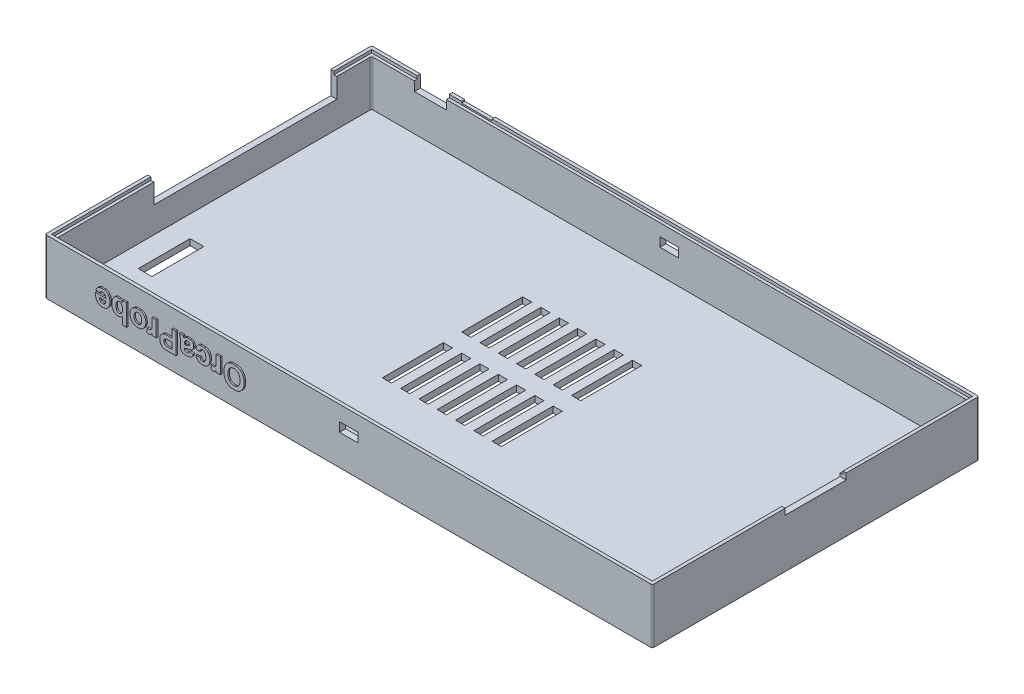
from build123d import *

# Parameters (mm, degrees)
SKETCH1_W               = 195
SKETCH1_H               = 103
BOSS_EXTRUDE1_DEPTH     = 2
SKETCH2_W               = 199
SKETCH2_H               = 107
SKETCH2_W_2             = 195
SKETCH2_H_2             = 103
BOSS_EXTRUDE2_DEPTH     = 18
SKETCH5_W               = 196.9
SKETCH5_H               = 104.9
SKETCH5_W_2             = 195
SKETCH5_H_2             = 103
CUT_EXTRUDE2_DEPTH      = 1
CUT_EXTRUDE3_DEPTH      = 146.77122487
CUT_EXTRUDE3_DEPTH_BACK = 146.77122487
SKETCH7_W               = 6.1
SKETCH7_H               = 3
SKETCH9_W               = 60
SKETCH9_H               = 7.5
CUT_EXTRUDE6_DEPTH      = 2
SKETCH10_W              = 10.5
SKETCH10_H              = 4
SKETCH10_W_2            = 10
SKETCH10_H_2            = 0.5
CUT_EXTRUDE7_DEPTH      = 2
SKETCH11_W              = 4.5
SKETCH11_H              = 17
CUT_EXTRUDE8_DEPTH      = 2
SKETCH12_W              = 3
SKETCH12_H              = 20
CUT_EXTRUDE9_DEPTH      = 2
FILLET1_R               = 0.5
SKETCH13_W              = 20
SKETCH13_H              = 2
CUT_EXTRUDE10_DEPTH     = 2
BOSS_EXTRUDE3_DEPTH     = 0.5


with BuildPart() as part:
    # Sketch1 → Boss-Extrude1 (new body)
    with BuildSketch(Plane(origin=(0, 0, 0), x_dir=(1, 0, 0), z_dir=(0, 1, 0))):
        Rectangle(SKETCH1_W, SKETCH1_H)
    extrude(amount=BOSS_EXTRUDE1_DEPTH)

    # Sketch2 → Boss-Extrude2 (add)
    with BuildSketch(Plane.XZ):
        Rectangle(SKETCH2_W, SKETCH2_H)
        Rectangle(SKETCH2_W_2, SKETCH2_H_2, mode=Mode.SUBTRACT)
    extrude(amount=-BOSS_EXTRUDE2_DEPTH)

    # Sketch5 → Cut-Extrude2 (cut)
    with BuildSketch(Plane(origin=(0, 18, 0), x_dir=(1, 0, 0), z_dir=(0, 1, 0))):
        Rectangle(SKETCH5_W, SKETCH5_H)
        Rectangle(SKETCH5_W_2, SKETCH5_H_2, mode=Mode.SUBTRACT)
    extrude(amount=-CUT_EXTRUDE2_DEPTH, mode=Mode.SUBTRACT)

    # Sketch7 → Cut-Extrude3 (cut, two sides: drawn at the far end of the back side and taken through both)
    with BuildSketch(Plane.XY.offset(-51.5).offset(-CUT_EXTRUDE3_DEPTH_BACK)):
        with Locations((0, 11.55)):
            Rectangle(SKETCH7_W, SKETCH7_H)
    extrude(amount=CUT_EXTRUDE3_DEPTH + CUT_EXTRUDE3_DEPTH_BACK, mode=Mode.SUBTRACT)

    # Sketch9 → Cut-Extrude6 (cut)
    with BuildSketch(Plane.ZY.offset(99.5)):
        with Locations((-10.12, 14.25)):
            Rectangle(SKETCH9_W, SKETCH9_H)
    extrude(amount=-CUT_EXTRUDE6_DEPTH, mode=Mode.SUBTRACT)

    # Sketch10 → Cut-Extrude7 (cut)
    with BuildSketch(Plane(origin=(0, 0, -53.5), x_dir=(-1, 0, 0), z_dir=(0, 0, -1))):
        with Locations((78.25, 16)):
            Rectangle(SKETCH10_W, SKETCH10_H)
        with Locations((64, 17.75)):
            Rectangle(SKETCH10_W_2, SKETCH10_H_2)
    extrude(amount=-CUT_EXTRUDE7_DEPTH, mode=Mode.SUBTRACT)

    # Sketch11 → Cut-Extrude8 (cut)
    with BuildSketch(Plane.XZ):
        with Locations((-88.25, 23.5)):
            Rectangle(SKETCH11_W, SKETCH11_H)
    extrude(amount=-CUT_EXTRUDE8_DEPTH, mode=Mode.SUBTRACT)

    # Sketch12 → Cut-Extrude9 (cut)
    with BuildSketch(Plane.XZ):
        with Locations((18, 13)):
            Rectangle(SKETCH12_W, SKETCH12_H)
        with Locations((12, 13)):
            Rectangle(SKETCH12_W, SKETCH12_H)
        with Locations((6, 13)):
            Rectangle(SKETCH12_W, SKETCH12_H)
        with Locations((0, 13)):
            Rectangle(SKETCH12_W, SKETCH12_H)
        with Locations((-6, 13)):
            Rectangle(SKETCH12_W, SKETCH12_H)
        with Locations((-12, 13)):
            Rectangle(SKETCH12_W, SKETCH12_H)
        with Locations((-18, 13)):
            Rectangle(SKETCH12_W, SKETCH12_H)
        with Locations((-18, -13)):
            Rectangle(SKETCH12_W, SKETCH12_H)
        with Locations((-12, -13)):
            Rectangle(SKETCH12_W, SKETCH12_H)
        with Locations((-6, -13)):
            Rectangle(SKETCH12_W, SKETCH12_H)
        with Locations((0, -13)):
            Rectangle(SKETCH12_W, SKETCH12_H)
        with Locations((6, -13)):
            Rectangle(SKETCH12_W, SKETCH12_H)
        with Locations((12, -13)):
            Rectangle(SKETCH12_W, SKETCH12_H)
        with Locations((18, -13)):
            Rectangle(SKETCH12_W, SKETCH12_H)
    extrude(amount=-CUT_EXTRUDE9_DEPTH, mode=Mode.SUBTRACT)

    # Fillet1
    fillet1_edges = [part.edges().sort_by_distance(p)[0] for p in [
        (99.5, 9, -53.5),
        (-99.5, 9, -53.5),
        (-99.5, 9, 53.5),
        (99.5, 9, 53.5),
        (97.5, 9.5, 51.5),
        (97.5, 9.5, -51.5),
        (-97.5, 9.5, 51.5),
        (-97.5, 9.5, -51.5),
    ]]
    fillet(fillet1_edges, radius=FILLET1_R)

    # Sketch13 → Cut-Extrude10 (cut)
    with BuildSketch(Plane(origin=(99.5, 0, 0), x_dir=(0, 0, -1), z_dir=(1, 0, 0))):
        with Locations((0, 17)):
            Rectangle(SKETCH13_W, SKETCH13_H)
    extrude(amount=-CUT_EXTRUDE10_DEPTH, mode=Mode.SUBTRACT)

    # Sketch8 → Boss-Extrude3 (add)
    # profile 1 of 9: a face of its own
    with BuildSketch(Plane.XY.offset(53.5)):
        with BuildLine():
            add(Edge.make_bspline(
                [(-79.430913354, 12.41834972), (-79.392604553, 12.408414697), (-79.266749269, 12.372799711), (-79.060539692, 12.29960703), (-78.825897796, 12.174820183), (-78.53667685, 11.978505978), (-78.358577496, 11.783308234), (-78.253719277, 11.644311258)],
                knots=[0.353866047, 0.353866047, 0.353866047, 0.353866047, 0.407200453, 0.530030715, 0.648157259, 0.764596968, 1, 1, 1, 1], degree=3))
            Line((-79.430913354, 12.41834972), (-80.951445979, 12.41834972))
            add(Edge.make_bspline(
                [(-82.418382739, 10.982452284), (-82.377144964, 11.102309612), (-82.305803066, 11.276218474), (-82.185018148, 11.491211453), (-82.089189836, 11.640443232), (-81.981871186, 11.777266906), (-81.864631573, 11.90199217), (-81.740376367, 12.018070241), (-81.604770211, 12.12017176), (-81.461028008, 12.211909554), (-81.308563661, 12.292420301), (-81.145654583, 12.357157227), (-81.025836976, 12.397918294), (-80.959939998, 12.416074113), (-80.951445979, 12.41834972)],
                knots=[0, 0, 0, 0, 0.131626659, 0.194390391, 0.255749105, 0.31553027, 0.374568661, 0.433277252, 0.491785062, 0.550461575, 0.610134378, 0.670403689, 0.73222858, 0.741356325, 0.741356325, 0.741356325, 0.741356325], degree=3))
            Line((-82.418382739, 10.982452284), (-81.072228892, 10.802965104))
            add(Edge.make_bspline(
                [(-80.208446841, 11.520913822), (-80.306629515, 11.51854586), (-80.454421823, 11.504680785), (-80.630237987, 11.427555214), (-80.748257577, 11.352564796), (-80.852225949, 11.252165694), (-80.976862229, 11.074695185), (-81.03929334, 10.915977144), (-81.072228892, 10.802965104)],
                knots=[0, 0, 0, 0, 0.243297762, 0.357088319, 0.469306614, 0.585549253, 0.70993853, 1, 1, 1, 1], degree=3))
            add(Edge.make_bspline(
                [(-79.097869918, 10.264503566), (-79.101712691, 10.358110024), (-79.109784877, 10.496623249), (-79.149459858, 10.671707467), (-79.183533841, 10.793037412), (-79.23007259, 10.904538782), (-79.285279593, 11.008445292), (-79.349753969, 11.104197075), (-79.424033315, 11.190812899), (-79.505440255, 11.26765374), (-79.591279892, 11.335287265), (-79.681300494, 11.393834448), (-79.777720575, 11.439926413), (-79.878558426, 11.47678371), (-80.021987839, 11.51043407), (-80.133214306, 11.520703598), (-80.208446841, 11.520913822)],
                knots=[0, 0, 0, 0, 0.149899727, 0.220143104, 0.286246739, 0.350812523, 0.412562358, 0.473814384, 0.534669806, 0.594305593, 0.652217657, 0.708925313, 0.765317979, 0.82243155, 0.8799772, 1, 1, 1, 1], degree=3))
            Line((-79.097869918, 10.264503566), (-82.508126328, 10.264503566))
            add(Edge.make_bspline(
                [(-80.086451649, 7.213221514), (-80.266742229, 7.21279231), (-80.532239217, 7.233364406), (-80.870493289, 7.313109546), (-81.103376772, 7.39671767), (-81.322218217, 7.501742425), (-81.525697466, 7.631623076), (-81.712653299, 7.786312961), (-81.886879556, 7.961288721), (-82.040309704, 8.163623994), (-82.172128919, 8.390955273), (-82.283111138, 8.642610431), (-82.372812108, 8.918811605), (-82.439093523, 9.220433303), (-82.502057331, 9.670431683), (-82.513628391, 10.022647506), (-82.508126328, 10.264503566)],
                knots=[0, 0, 0, 0, 0.12167826, 0.178742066, 0.234004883, 0.288309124, 0.3421997, 0.39643063, 0.451736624, 0.508442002, 0.567237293, 0.62865367, 0.693678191, 0.762844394, 0.836746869, 1, 1, 1, 1], degree=3))
            add(Edge.make_bspline(
                [(-77.751716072, 9.898517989), (-77.751429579, 9.699325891), (-77.768915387, 9.4072879), (-77.83930111, 9.033294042), (-77.912568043, 8.77721736), (-78.004321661, 8.537437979), (-78.119304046, 8.315508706), (-78.253531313, 8.109665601), (-78.409859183, 7.923891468), (-78.580250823, 7.756912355), (-78.763750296, 7.612290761), (-78.956107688, 7.486963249), (-79.161610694, 7.387740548), (-79.376754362, 7.307853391), (-79.684683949, 7.235214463), (-79.924167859, 7.212550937), (-80.086451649, 7.213221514)],
                knots=[0, 0, 0, 0, 0.149253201, 0.218402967, 0.284676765, 0.348527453, 0.41038283, 0.471562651, 0.532217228, 0.591888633, 0.649960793, 0.70697197, 0.76350051, 0.820546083, 0.87854748, 1, 1, 1, 1], degree=3))
            add(Edge.make_bspline(
                [(-78.253719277, 11.644311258), (-78.169261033, 11.528485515), (-78.058035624, 11.342120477), (-77.944666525, 11.073846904), (-77.872853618, 10.86126967), (-77.818479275, 10.636430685), (-77.764763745, 10.315799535), (-77.753605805, 10.067012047), (-77.751716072, 9.898517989)],
                knots=[0, 0, 0, 0, 0.232769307, 0.350791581, 0.472503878, 0.59678617, 0.726082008, 1, 1, 1, 1], degree=3))
        make_face()
        with BuildLine():
            Line((-81.161972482, 9.456811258), (-79.121708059, 9.456811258))
            add(Edge.make_bspline(
                [(-79.407765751, 8.538341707), (-79.359867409, 8.59527401), (-79.295556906, 8.688722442), (-79.228926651, 8.825832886), (-79.187987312, 8.937611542), (-79.157388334, 9.056970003), (-79.129258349, 9.230401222), (-79.121565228, 9.364974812), (-79.121708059, 9.456811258)],
                knots=[0, 0, 0, 0, 0.226972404, 0.344350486, 0.464385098, 0.589620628, 0.71976358, 1, 1, 1, 1], degree=3))
            add(Edge.make_bspline(
                [(-80.146748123, 8.200401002), (-80.074963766, 8.201448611), (-79.96814089, 8.209504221), (-79.832830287, 8.246199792), (-79.737577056, 8.282744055), (-79.647293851, 8.33093424), (-79.531847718, 8.410625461), (-79.455172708, 8.484893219), (-79.407765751, 8.538341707)],
                knots=[0, 0, 0, 0, 0.257037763, 0.379787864, 0.499815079, 0.620848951, 0.744538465, 1, 1, 1, 1], degree=3))
            add(Edge.make_bspline(
                [(-81.161972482, 9.456811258), (-81.158152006, 9.360299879), (-81.149320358, 9.218871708), (-81.115842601, 9.038361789), (-81.079329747, 8.916621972), (-81.038734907, 8.803271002), (-80.987592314, 8.699238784), (-80.926886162, 8.605084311), (-80.858852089, 8.519863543), (-80.783360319, 8.444999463), (-80.704327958, 8.37929489), (-80.620594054, 8.323870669), (-80.533488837, 8.279047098), (-80.442493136, 8.24327095), (-80.314372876, 8.209156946), (-80.213811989, 8.201998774), (-80.146748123, 8.200401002)],
                knots=[0, 0, 0, 0, 0.160305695, 0.234505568, 0.303939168, 0.370905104, 0.434007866, 0.495728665, 0.55638862, 0.614498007, 0.671773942, 0.726605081, 0.780696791, 0.833965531, 0.888499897, 1, 1, 1, 1], degree=3))
        make_face(mode=Mode.SUBTRACT)
    # profile 2 of 9: a face of its own
    with BuildSketch(Plane.XY.offset(53.5)):
        with BuildLine():
            Line((-72.277357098, 5.41834972), (-72.277357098, 12.41834972))
            Line((-72.277357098, 12.41834972), (-73.623510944, 12.41834972))
            Line((-73.623510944, 12.41834972), (-73.623510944, 11.679367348))
            add(Edge.make_bspline(
                [(-74.582243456, 12.41834972), (-74.558862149, 12.410350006), (-74.466900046, 12.376947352), (-74.308275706, 12.30789419), (-74.114291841, 12.193870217), (-73.870695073, 11.995504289), (-73.714084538, 11.81390674), (-73.623510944, 11.679367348)],
                knots=[0.307928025, 0.307928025, 0.307928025, 0.307928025, 0.349517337, 0.472531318, 0.598900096, 0.727130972, 1, 1, 1, 1], degree=3))
            Line((-74.582243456, 12.41834972), (-75.687295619, 12.41834972))
            add(Edge.make_bspline(
                [(-77.123510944, 9.808774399), (-77.121340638, 10.012764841), (-77.109224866, 10.311667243), (-77.044583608, 10.693611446), (-76.983283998, 10.954213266), (-76.899344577, 11.194861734), (-76.800668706, 11.418542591), (-76.680452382, 11.622292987), (-76.545053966, 11.807796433), (-76.394505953, 11.971262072), (-76.23626016, 12.115012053), (-76.069866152, 12.237206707), (-75.894780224, 12.335463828), (-75.765356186, 12.391237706), (-75.695370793, 12.415611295), (-75.687295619, 12.41834972)],
                knots=[0, 0, 0, 0, 0.162916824, 0.23775729, 0.308743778, 0.376187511, 0.440770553, 0.503436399, 0.56451039, 0.62362394, 0.680380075, 0.73481972, 0.787909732, 0.840195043, 0.846993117, 0.846993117, 0.846993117, 0.846993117], degree=3))
            add(Edge.make_bspline(
                [(-75.049592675, 7.213221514), (-75.193796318, 7.210912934), (-75.406500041, 7.233937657), (-75.679789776, 7.302657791), (-75.871058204, 7.378304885), (-76.053536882, 7.472303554), (-76.225548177, 7.588835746), (-76.38871655, 7.724943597), (-76.540065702, 7.88243775), (-76.677875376, 8.058947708), (-76.797374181, 8.255323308), (-76.898493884, 8.469757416), (-76.981100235, 8.702356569), (-77.045369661, 8.953464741), (-77.108505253, 9.322780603), (-77.121673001, 9.611701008), (-77.123510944, 9.808774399)],
                knots=[0, 0, 0, 0, 0.115439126, 0.170815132, 0.225536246, 0.280032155, 0.335141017, 0.391830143, 0.450160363, 0.510003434, 0.571085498, 0.634139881, 0.699833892, 0.768758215, 0.841794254, 1, 1, 1, 1], degree=3))
            add(Edge.make_bspline(
                [(-73.623510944, 7.912941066), (-73.719150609, 7.802384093), (-73.872597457, 7.649805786), (-74.102045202, 7.484408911), (-74.278408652, 7.386142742), (-74.460735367, 7.307360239), (-74.716136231, 7.234128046), (-74.91586354, 7.213621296), (-75.049592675, 7.213221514)],
                knots=[0, 0, 0, 0, 0.267280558, 0.393392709, 0.515772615, 0.635564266, 0.755599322, 1, 1, 1, 1], degree=3))
            Line((-73.623510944, 7.912941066), (-73.623510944, 5.41834972))
            Line((-73.623510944, 5.41834972), (-72.277357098, 5.41834972))
        make_face()
        with BuildLine():
            add(Edge.make_bspline(
                [(-73.623510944, 9.763902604), (-73.6240605, 9.891141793), (-73.630219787, 10.075398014), (-73.655307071, 10.311333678), (-73.680005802, 10.468815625), (-73.712916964, 10.613455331), (-73.768068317, 10.781544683), (-73.817818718, 10.899214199), (-73.861892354, 10.968429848)],
                knots=[0, 0, 0, 0, 0.307438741, 0.444851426, 0.572938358, 0.69235567, 0.802694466, 1, 1, 1, 1], degree=3))
            add(Edge.make_bspline(
                [(-74.700434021, 8.200401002), (-74.626060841, 8.199855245), (-74.515151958, 8.21099853), (-74.374909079, 8.253067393), (-74.275305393, 8.295317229), (-74.181307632, 8.350869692), (-74.090793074, 8.416703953), (-74.006383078, 8.496089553), (-73.928117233, 8.587408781), (-73.855645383, 8.690585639), (-73.792853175, 8.806698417), (-73.74107325, 8.936400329), (-73.697929, 9.07756948), (-73.664294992, 9.231393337), (-73.632451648, 9.460867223), (-73.621776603, 9.64019027), (-73.623510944, 9.763902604)],
                knots=[0, 0, 0, 0, 0.104727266, 0.15551648, 0.205619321, 0.256621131, 0.308859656, 0.36285414, 0.419298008, 0.477882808, 0.539996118, 0.604622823, 0.674128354, 0.747555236, 0.825986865, 1, 1, 1, 1], degree=3))
            add(Edge.make_bspline(
                [(-75.777357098, 9.892909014), (-75.777792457, 9.753465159), (-75.770448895, 9.551602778), (-75.738129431, 9.294091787), (-75.704359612, 9.124131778), (-75.663067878, 8.969021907), (-75.611359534, 8.829341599), (-75.549990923, 8.705539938), (-75.479313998, 8.597201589), (-75.399541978, 8.504627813), (-75.316335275, 8.422798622), (-75.226404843, 8.354753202), (-75.132269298, 8.297973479), (-75.031855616, 8.254109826), (-74.888723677, 8.212988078), (-74.776516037, 8.198622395), (-74.700434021, 8.200401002)],
                knots=[0, 0, 0, 0, 0.185432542, 0.268143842, 0.344806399, 0.415664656, 0.481346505, 0.542490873, 0.599027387, 0.652819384, 0.704681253, 0.753902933, 0.802397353, 0.850544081, 0.899118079, 1, 1, 1, 1], degree=3))
            add(Edge.make_bspline(
                [(-74.75091479, 11.520913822), (-74.819833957, 11.521771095), (-74.922659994, 11.509711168), (-75.053521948, 11.468379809), (-75.146519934, 11.423693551), (-75.236894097, 11.369685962), (-75.32154706, 11.30061253), (-75.403018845, 11.220579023), (-75.480259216, 11.128040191), (-75.550708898, 11.022067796), (-75.612896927, 10.902590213), (-75.662460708, 10.767879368), (-75.704403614, 10.620182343), (-75.738013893, 10.458565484), (-75.770437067, 10.215122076), (-75.777634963, 10.024402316), (-75.777357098, 9.892909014)],
                knots=[0, 0, 0, 0, 0.096057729, 0.143290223, 0.190845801, 0.23972458, 0.28983653, 0.342872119, 0.398902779, 0.457689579, 0.520111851, 0.586368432, 0.657587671, 0.734204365, 0.816477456, 1, 1, 1, 1], degree=3))
            add(Edge.make_bspline(
                [(-73.861892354, 10.968429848), (-73.914107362, 11.054346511), (-74.001312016, 11.173933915), (-74.14052773, 11.306002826), (-74.248913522, 11.385618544), (-74.364766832, 11.446550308), (-74.530515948, 11.50347887), (-74.661840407, 11.522125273), (-74.75091479, 11.520913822)],
                knots=[0, 0, 0, 0, 0.274838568, 0.40126574, 0.5228099, 0.641009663, 0.757284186, 1, 1, 1, 1], degree=3))
        make_face(mode=Mode.SUBTRACT)
    # profile 3 of 9: a face of its own
    with BuildSketch(Plane.XY.offset(53.5)):
        with BuildLine():
            add(Edge.make_bspline(
                [(-67.879764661, 12.41834972), (-67.784464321, 12.393742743), (-67.580079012, 12.329070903), (-67.329847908, 12.221315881), (-67.126751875, 12.112442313), (-66.983050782, 12.01980257), (-66.850365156, 11.91642609), (-66.723695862, 11.807533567), (-66.609514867, 11.686250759), (-66.503297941, 11.55696825), (-66.408426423, 11.417346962), (-66.321162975, 11.270137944), (-66.243571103, 11.114334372), (-66.178440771, 10.949138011), (-66.120160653, 10.776845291), (-66.074116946, 10.595386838), (-66.039489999, 10.405558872), (-66.005289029, 10.136541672), (-65.995796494, 9.929569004), (-65.995305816, 9.789142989)],
                knots=[0.171454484, 0.171454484, 0.171454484, 0.171454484, 0.240839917, 0.32234078, 0.363196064, 0.403242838, 0.442734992, 0.48174409, 0.52091302, 0.560038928, 0.599628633, 0.639823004, 0.680657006, 0.722218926, 0.764956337, 0.808847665, 0.854104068, 0.900958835, 1, 1, 1, 1], degree=3))
            Line((-67.879764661, 12.41834972), (-69.328766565, 12.41834972))
            add(Edge.make_bspline(
                [(-71.200434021, 9.846634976), (-71.201661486, 10.030802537), (-71.178648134, 10.302646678), (-71.101482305, 10.65271963), (-71.019570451, 10.897963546), (-70.917164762, 11.132347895), (-70.788537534, 11.352585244), (-70.637766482, 11.561089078), (-70.466029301, 11.755271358), (-70.275963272, 11.931003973), (-70.07287766, 12.086305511), (-69.856337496, 12.215597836), (-69.629466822, 12.323411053), (-69.450907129, 12.385165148), (-69.349293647, 12.413003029), (-69.328766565, 12.41834972)],
                knots=[0, 0, 0, 0, 0.132653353, 0.19582782, 0.257932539, 0.318712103, 0.379841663, 0.441362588, 0.503887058, 0.566340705, 0.627650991, 0.687791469, 0.747765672, 0.808383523, 0.82366603, 0.82366603, 0.82366603, 0.82366603], degree=3))
            add(Edge.make_bspline(
                [(-68.593663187, 7.213221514), (-68.776699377, 7.21301585), (-69.047348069, 7.233491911), (-69.393113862, 7.31372267), (-69.635314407, 7.395300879), (-69.864365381, 7.501119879), (-70.081759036, 7.628756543), (-70.284758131, 7.781841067), (-70.473080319, 7.956236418), (-70.642796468, 8.148941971), (-70.793224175, 8.354151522), (-70.917995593, 8.57358926), (-71.022861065, 8.80401676), (-71.102763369, 9.047677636), (-71.177969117, 9.394532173), (-71.201919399, 9.663817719), (-71.200434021, 9.846634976)],
                knots=[0, 0, 0, 0, 0.132270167, 0.195000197, 0.25596101, 0.316536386, 0.376926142, 0.437695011, 0.499808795, 0.561994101, 0.622905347, 0.683246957, 0.743989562, 0.805483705, 0.868064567, 1, 1, 1, 1], degree=3))
            add(Edge.make_bspline(
                [(-65.995305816, 9.789142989), (-65.997193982, 9.5685478), (-66.035057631, 9.234118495), (-66.175833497, 8.806748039), (-66.293880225, 8.545738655), (-66.406595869, 8.344165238), (-66.502251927, 8.201932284), (-66.604398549, 8.06722005), (-66.717594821, 7.944008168), (-66.837849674, 7.82848494), (-66.967811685, 7.723278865), (-67.105119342, 7.626062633), (-67.25121691, 7.539448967), (-67.403058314, 7.462663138), (-67.560400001, 7.396867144), (-67.720729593, 7.33817503), (-67.887384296, 7.294793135), (-68.057331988, 7.256946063), (-68.293017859, 7.224280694), (-68.472757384, 7.213311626), (-68.593663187, 7.213221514)],
                knots=[0, 0, 0, 0, 0.161817, 0.244248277, 0.328865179, 0.371350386, 0.413339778, 0.454376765, 0.495112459, 0.535813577, 0.576469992, 0.6175227, 0.658994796, 0.700813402, 0.742101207, 0.783919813, 0.825797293, 0.868188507, 0.91144544, 1, 1, 1, 1], degree=3))
        make_face()
        with BuildLine():
            add(Edge.make_bspline(
                [(-67.341459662, 9.860657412), (-67.341261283, 9.98717126), (-67.351550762, 10.171953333), (-67.388551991, 10.409112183), (-67.429933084, 10.569141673), (-67.479887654, 10.718509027), (-67.543285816, 10.855227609), (-67.615732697, 10.981886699), (-67.701951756, 11.093748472), (-67.795922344, 11.192768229), (-67.894412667, 11.280753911), (-67.998388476, 11.355669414), (-68.10848953, 11.416590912), (-68.224575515, 11.462791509), (-68.387279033, 11.5087288), (-68.515148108, 11.520123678), (-68.600674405, 11.520913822)],
                knots=[0, 0, 0, 0, 0.162282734, 0.237014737, 0.307558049, 0.374124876, 0.438795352, 0.500611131, 0.560942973, 0.619486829, 0.675564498, 0.730150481, 0.783564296, 0.836572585, 0.890117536, 1, 1, 1, 1], degree=3))
            add(Edge.make_bspline(
                [(-68.600674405, 8.200401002), (-68.515148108, 8.201191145), (-68.387279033, 8.212586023), (-68.224575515, 8.258523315), (-68.10848953, 8.304723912), (-67.998388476, 8.36564541), (-67.894412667, 8.440560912), (-67.795922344, 8.528546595), (-67.701951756, 8.627566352), (-67.615732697, 8.739428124), (-67.543285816, 8.866087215), (-67.479887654, 9.002805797), (-67.429933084, 9.152173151), (-67.388551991, 9.31220264), (-67.351550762, 9.549361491), (-67.341261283, 9.734143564), (-67.341459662, 9.860657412)],
                knots=[0, 0, 0, 0, 0.109882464, 0.163427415, 0.216435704, 0.269849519, 0.324435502, 0.380513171, 0.439057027, 0.499388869, 0.561204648, 0.625875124, 0.692441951, 0.762985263, 0.837717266, 1, 1, 1, 1], degree=3))
            add(Edge.make_bspline(
                [(-69.854280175, 9.850841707), (-69.854301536, 9.725780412), (-69.844701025, 9.543155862), (-69.806586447, 9.30916824), (-69.767351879, 9.150163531), (-69.717490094, 9.001744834), (-69.65356465, 8.86574324), (-69.581337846, 8.739830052), (-69.496629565, 8.627635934), (-69.403975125, 8.528139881), (-69.305480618, 8.440622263), (-69.201588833, 8.365587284), (-69.091767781, 8.305102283), (-68.976434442, 8.258210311), (-68.814015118, 8.212720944), (-68.686229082, 8.201121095), (-68.600674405, 8.200401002)],
                knots=[0, 0, 0, 0, 0.161389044, 0.235349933, 0.305557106, 0.372497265, 0.436982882, 0.499145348, 0.559451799, 0.61791174, 0.674303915, 0.729196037, 0.782909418, 0.83565602, 0.889501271, 1, 1, 1, 1], degree=3))
            add(Edge.make_bspline(
                [(-68.600674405, 11.520913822), (-68.686228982, 11.520193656), (-68.814015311, 11.508594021), (-68.976434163, 11.463104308), (-69.091768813, 11.416213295), (-69.201584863, 11.355724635), (-69.305495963, 11.280703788), (-69.403915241, 11.193131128), (-69.497121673, 11.093577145), (-69.580846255, 10.980192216), (-69.654003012, 10.853928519), (-69.717399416, 10.716686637), (-69.767584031, 10.566526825), (-69.806698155, 10.404656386), (-69.844625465, 10.165495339), (-69.854324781, 9.978705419), (-69.854280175, 9.850841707)],
                knots=[0, 0, 0, 0, 0.109603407, 0.163012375, 0.215331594, 0.26860976, 0.323057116, 0.37899237, 0.436978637, 0.497276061, 0.558934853, 0.623441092, 0.690404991, 0.761205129, 0.836337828, 1, 1, 1, 1], degree=3))
        make_face(mode=Mode.SUBTRACT)
    # profile 4 of 9: a face of its own
    with BuildSketch(Plane.XY.offset(53.5)):
        with BuildLine():
            add(Edge.make_bspline(
                [(-64.800594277, 8.559375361), (-64.715766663, 8.559546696), (-64.590336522, 8.57696009), (-64.437206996, 8.639966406), (-64.334679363, 8.707748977), (-64.241963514, 8.800743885), (-64.162663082, 8.924544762), (-64.093609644, 9.077260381), (-64.044681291, 9.227237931), (-64.012372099, 9.372407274), (-63.99081635, 9.511556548), (-63.971126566, 9.67754856), (-63.956373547, 9.870295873), (-63.945644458, 10.090078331), (-63.934098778, 10.436413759), (-63.930372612, 10.709923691), (-63.931203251, 10.901122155)],
                knots=[0, 0, 0, 0, 0.091622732, 0.134828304, 0.177797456, 0.223472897, 0.275539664, 0.335599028, 0.404061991, 0.445443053, 0.496051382, 0.556017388, 0.625879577, 0.704707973, 0.793577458, 1, 1, 1, 1], degree=3))
            Line((-63.931203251, 10.901122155), (-63.931203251, 12.41834972))
            Line((-63.931203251, 12.41834972), (-62.585049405, 12.41834972))
            Line((-62.585049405, 12.41834972), (-62.585049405, 7.302965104))
            Line((-62.585049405, 7.302965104), (-63.931203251, 7.302965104))
            Line((-63.931203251, 7.302965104), (-63.931203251, 8.016707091))
            add(Edge.make_bspline(
                [(-63.931203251, 8.016707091), (-63.976455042, 7.939297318), (-64.039781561, 7.826622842), (-64.131869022, 7.689363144), (-64.196726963, 7.60210042), (-64.258749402, 7.52517554), (-64.320044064, 7.460011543), (-64.377829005, 7.404486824), (-64.455051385, 7.348977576), (-64.553467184, 7.294618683), (-64.721771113, 7.231364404), (-64.8570029, 7.213413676), (-64.947829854, 7.213221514)],
                knots=[0, 0, 0, 0, 0.196067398, 0.282205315, 0.361075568, 0.43367543, 0.498005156, 0.556559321, 0.608461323, 0.705407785, 0.80142392, 1, 1, 1, 1], degree=3))
            add(Edge.make_bspline(
                [(-64.947829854, 7.213221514), (-65.08302601, 7.21322473), (-65.363437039, 7.265782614), (-65.609644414, 7.409214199), (-65.726075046, 7.49647472)],
                knots=[0, 0, 0, 0, 0.480615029, 1, 1, 1, 1], degree=3))
            Line((-65.726075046, 7.49647472), (-65.411972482, 8.776723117))
            add(Edge.make_bspline(
                [(-65.411972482, 8.776723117), (-65.313231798, 8.710616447), (-65.118274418, 8.605659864), (-64.901265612, 8.559745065), (-64.800594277, 8.559375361)],
                knots=[0, 0, 0, 0, 0.542856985, 1, 1, 1, 1], degree=3))
        make_face()
    # profile 5 of 9: a face of its own
    with BuildSketch(Plane.XY.offset(53.5)):
        with BuildLine():
            add(Edge.make_bspline(
                [(-59.857685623, 9.714824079), (-59.764327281, 9.733197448), (-59.616871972, 9.756692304), (-59.409613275, 9.777582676), (-59.23335047, 9.791516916), (-59.042597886, 9.80248087), (-58.760332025, 9.814532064), (-58.54143856, 9.815163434), (-58.390938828, 9.815785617)],
                knots=[0, 0, 0, 0, 0.193875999, 0.303996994, 0.424377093, 0.554127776, 0.693295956, 1, 1, 1, 1], degree=3))
            Line((-58.390938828, 9.815785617), (-57.46966479, 9.815785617))
            Line((-57.46966479, 9.815785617), (-57.46966479, 12.41834972))
            Line((-57.46966479, 12.41834972), (-56.123510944, 12.41834972))
            Line((-56.123510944, 12.41834972), (-56.123510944, 5.41834972))
            Line((-56.123510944, 5.41834972), (-58.362893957, 5.41834972))
            add(Edge.make_bspline(
                [(-58.362893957, 5.41834972), (-58.556426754, 5.417538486), (-58.833214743, 5.421184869), (-59.183746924, 5.432863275), (-59.405423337, 5.443279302), (-59.598997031, 5.458690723), (-59.802662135, 5.480802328), (-59.941380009, 5.502271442), (-60.023150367, 5.524920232)],
                knots=[0, 0, 0, 0, 0.348329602, 0.498164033, 0.631257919, 0.747723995, 0.847596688, 1, 1, 1, 1], degree=3))
            add(Edge.make_bspline(
                [(-60.023150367, 5.524920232), (-60.121225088, 5.549501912), (-60.263157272, 5.602297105), (-60.442684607, 5.694061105), (-60.569608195, 5.77582306), (-60.69171665, 5.867386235), (-60.806411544, 5.971807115), (-60.916450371, 6.087250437), (-61.019440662, 6.214060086), (-61.114407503, 6.351492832), (-61.194995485, 6.500467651), (-61.264475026, 6.658382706), (-61.319879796, 6.826246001), (-61.36570278, 7.00307167), (-61.405931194, 7.258474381), (-61.420445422, 7.45576125), (-61.418382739, 7.59042504)],
                knots=[0, 0, 0, 0, 0.112518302, 0.168209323, 0.224431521, 0.280595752, 0.338142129, 0.397105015, 0.458213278, 0.520063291, 0.583016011, 0.646708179, 0.712116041, 0.779846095, 0.850080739, 1, 1, 1, 1], degree=3))
            add(Edge.make_bspline(
                [(-61.418382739, 7.59042504), (-61.420478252, 7.791397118), (-61.393143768, 8.083024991), (-61.294611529, 8.447455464), (-61.190201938, 8.683170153), (-61.065614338, 8.89410801), (-60.92234837, 9.079971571), (-60.767095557, 9.245384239), (-60.593439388, 9.381635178), (-60.412545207, 9.495410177), (-60.173876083, 9.6224592), (-59.984428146, 9.686135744), (-59.857685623, 9.714824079)],
                knots=[0, 0, 0, 0, 0.210527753, 0.305147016, 0.39443888, 0.479888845, 0.561317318, 0.639975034, 0.71702342, 0.791910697, 0.86378715, 1, 1, 1, 1], degree=3))
        make_face()
        with BuildLine():
            add(Edge.make_bspline(
                [(-59.244905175, 6.634094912), (-59.190111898, 6.624423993), (-59.098939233, 6.614011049), (-58.965941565, 6.603872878), (-58.841109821, 6.596995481), (-58.699929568, 6.591640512), (-58.478395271, 6.58514846), (-58.303981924, 6.587054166), (-58.182004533, 6.585016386)],
                knots=[0, 0, 0, 0, 0.156655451, 0.258348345, 0.375719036, 0.508809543, 0.656332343, 1, 1, 1, 1], degree=3))
            Line((-58.182004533, 6.585016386), (-57.46966479, 6.585016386))
            Line((-57.46966479, 6.585016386), (-57.46966479, 8.64911895))
            Line((-57.46966479, 8.64911895), (-58.277357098, 8.64911895))
            add(Edge.make_bspline(
                [(-58.277357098, 8.64911895), (-58.410553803, 8.649050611), (-58.602001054, 8.647766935), (-58.844372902, 8.632649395), (-58.999893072, 8.623193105), (-59.136353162, 8.605790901), (-59.255444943, 8.586932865), (-59.356217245, 8.563485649), (-59.465538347, 8.528747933), (-59.58304272, 8.473554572), (-59.708106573, 8.391776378), (-59.816989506, 8.292852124), (-59.90833076, 8.178565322), (-59.981929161, 8.052156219), (-60.052473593, 7.864848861), (-60.073906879, 7.713860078), (-60.072228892, 7.611458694)],
                knots=[0, 0, 0, 0, 0.168840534, 0.24240189, 0.307726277, 0.366204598, 0.416643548, 0.460461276, 0.497173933, 0.561831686, 0.624256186, 0.685891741, 0.747404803, 0.808969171, 0.870459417, 1, 1, 1, 1], degree=3))
            add(Edge.make_bspline(
                [(-60.072228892, 7.611458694), (-60.07443269, 7.48860151), (-60.045606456, 7.307841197), (-59.945827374, 7.091005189), (-59.841884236, 6.953368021), (-59.716821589, 6.837156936), (-59.525040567, 6.709937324), (-59.358814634, 6.655431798), (-59.244905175, 6.634094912)],
                knots=[0, 0, 0, 0, 0.26321949, 0.386148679, 0.508700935, 0.630747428, 0.750908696, 1, 1, 1, 1], degree=3))
        make_face(mode=Mode.SUBTRACT)
    # profile 6 of 9: a face of its own
    with BuildSketch(Plane.XY.offset(53.5)):
        with BuildLine():
            add(Edge.make_bspline(
                [(-51.32489542, 12.41834972), (-51.306124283, 12.412640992), (-51.236432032, 12.39004817), (-51.120615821, 12.341355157), (-50.981714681, 12.266742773), (-50.853331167, 12.178324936), (-50.737613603, 12.075287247), (-50.632548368, 11.963861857), (-50.54089683, 11.844061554), (-50.462808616, 11.716953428), (-50.400157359, 11.582140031), (-50.350228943, 11.440436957), (-50.303360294, 11.238839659), (-50.28987214, 11.081635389), (-50.29017761, 10.975441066)],
                knots=[0.253709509, 0.253709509, 0.253709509, 0.253709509, 0.276749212, 0.339750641, 0.400909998, 0.461666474, 0.522343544, 0.582539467, 0.641278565, 0.699178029, 0.757378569, 0.815537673, 0.875321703, 1, 1, 1, 1], degree=3))
            Line((-51.32489542, 12.41834972), (-52.574472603, 12.41834972))
            add(Edge.make_bspline(
                [(-53.525153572, 11.819591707), (-53.415369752, 11.928680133), (-53.243110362, 12.08083921), (-52.988810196, 12.240535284), (-52.796780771, 12.338721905), (-52.656797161, 12.392631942), (-52.581952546, 12.41606008), (-52.574472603, 12.41834972)],
                knots=[0, 0, 0, 0, 0.265204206, 0.391031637, 0.513017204, 0.63379037, 0.647171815, 0.647171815, 0.647171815, 0.647171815], degree=3))
            add(Edge.make_bspline(
                [(-53.572829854, 11.989263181), (-53.56578801, 11.952962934), (-53.545180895, 11.897721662), (-53.533331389, 11.840007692), (-53.525153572, 11.819591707)],
                knots=[0, 0, 0, 0, 0.627225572, 1, 1, 1, 1], degree=3))
            add(Edge.make_bspline(
                [(-53.700434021, 12.41834972), (-53.678126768, 12.359537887), (-53.636327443, 12.216201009), (-53.594581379, 12.072928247), (-53.572829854, 11.989263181)],
                knots=[0, 0, 0, 0, 0.42098974, 1, 1, 1, 1], degree=3))
            Line((-53.700434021, 12.41834972), (-55.046587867, 12.41834972))
            add(Edge.make_bspline(
                [(-54.687613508, 10.745473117), (-54.6896027, 10.850117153), (-54.687096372, 11.001811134), (-54.699154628, 11.196039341), (-54.704225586, 11.325289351), (-54.716673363, 11.443417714), (-54.728251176, 11.550677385), (-54.74379143, 11.647070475), (-54.768314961, 11.762253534), (-54.808539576, 11.901560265), (-54.894148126, 12.133740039), (-54.982748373, 12.303517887), (-55.046587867, 12.41834972)],
                knots=[0, 0, 0, 0, 0.180906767, 0.261761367, 0.336164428, 0.404304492, 0.46690816, 0.52253452, 0.572900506, 0.670291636, 0.772747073, 1, 1, 1, 1], degree=3))
            Line((-54.687613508, 10.745473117), (-54.687613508, 9.173558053))
            add(Edge.make_bspline(
                [(-52.609488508, 7.213221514), (-52.746242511, 7.210425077), (-52.94395103, 7.221527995), (-53.198130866, 7.239869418), (-53.367640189, 7.265361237), (-53.524248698, 7.292470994), (-53.665841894, 7.332006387), (-53.795028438, 7.37212006), (-53.942860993, 7.439576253), (-54.106461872, 7.532584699), (-54.274962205, 7.661625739), (-54.412628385, 7.805200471), (-54.503595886, 7.9396621), (-54.557937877, 8.062355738), (-54.591892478, 8.171275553), (-54.623367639, 8.296048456), (-54.645646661, 8.438847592), (-54.666111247, 8.59818234), (-54.681640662, 8.845221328), (-54.688444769, 9.03881389), (-54.687613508, 9.173558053)],
                knots=[0, 0, 0, 0, 0.121260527, 0.175808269, 0.226097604, 0.273380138, 0.316760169, 0.356518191, 0.393297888, 0.460770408, 0.523183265, 0.5810023, 0.636702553, 0.66623588, 0.699827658, 0.73786837, 0.780366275, 0.828024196, 0.880439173, 1, 1, 1, 1], degree=3))
            add(Edge.make_bspline(
                [(-50.46966479, 8.64911895), (-50.502597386, 8.533165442), (-50.557387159, 8.363985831), (-50.657737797, 8.155017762), (-50.738820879, 8.012357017), (-50.829996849, 7.881951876), (-50.929771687, 7.763457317), (-51.038718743, 7.657280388), (-51.157356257, 7.562598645), (-51.287967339, 7.478489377), (-51.433516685, 7.407180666), (-51.593786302, 7.347140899), (-51.768550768, 7.298877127), (-51.957518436, 7.258579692), (-52.239243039, 7.224325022), (-52.458646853, 7.212407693), (-52.609488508, 7.213221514)],
                knots=[0, 0, 0, 0, 0.128109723, 0.188033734, 0.24582438, 0.302123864, 0.356697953, 0.410033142, 0.463347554, 0.517577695, 0.574607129, 0.6350629, 0.698994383, 0.766919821, 0.839974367, 1, 1, 1, 1], degree=3))
            Line((-50.46966479, 8.64911895), (-51.636331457, 8.82860613))
            add(Edge.make_bspline(
                [(-52.474873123, 8.200401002), (-52.37338225, 8.200358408), (-52.22677006, 8.212726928), (-52.051092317, 8.27448826), (-51.941511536, 8.335657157), (-51.847444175, 8.4224352), (-51.732254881, 8.581668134), (-51.670961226, 8.72529828), (-51.636331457, 8.82860613)],
                knots=[0, 0, 0, 0, 0.267292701, 0.380579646, 0.486622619, 0.594298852, 0.713526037, 1, 1, 1, 1], degree=3))
            add(Edge.make_bspline(
                [(-53.341459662, 8.880489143), (-53.34083933, 8.775280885), (-53.327619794, 8.621576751), (-53.245936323, 8.447806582), (-53.177626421, 8.365824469), (-53.109048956, 8.317379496), (-53.048104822, 8.284627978), (-52.976595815, 8.25889691), (-52.895317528, 8.237858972), (-52.804342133, 8.22156369), (-52.663369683, 8.203646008), (-52.551994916, 8.201529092), (-52.474873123, 8.200401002)],
                knots=[0, 0, 0, 0, 0.247438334, 0.350285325, 0.443786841, 0.492182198, 0.545326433, 0.604638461, 0.668872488, 0.740907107, 0.81998397, 1, 1, 1, 1], degree=3))
            Line((-53.341459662, 8.880489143), (-53.341459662, 9.008093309))
            add(Edge.make_bspline(
                [(-52.079440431, 9.344631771), (-52.219750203, 9.315688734), (-52.422110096, 9.275689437), (-52.678046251, 9.214580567), (-52.844676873, 9.17279778), (-52.993709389, 9.130786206), (-53.159323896, 9.080832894), (-53.272484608, 9.037575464), (-53.341459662, 9.008093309)],
                knots=[0, 0, 0, 0, 0.328590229, 0.47288822, 0.603397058, 0.722513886, 0.827959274, 1, 1, 1, 1], degree=3))
            add(Edge.make_bspline(
                [(-50.29017761, 10.975441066), (-50.291494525, 10.836217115), (-50.311330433, 10.628272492), (-50.398062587, 10.368882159), (-50.484593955, 10.190166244), (-50.594448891, 10.028408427), (-50.724685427, 9.88466135), (-50.876442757, 9.762075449), (-51.051107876, 9.657107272), (-51.255868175, 9.569392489), (-51.597204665, 9.450994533), (-51.87925239, 9.386803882), (-52.079440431, 9.344631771)],
                knots=[0, 0, 0, 0, 0.156294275, 0.231276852, 0.305251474, 0.377986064, 0.449497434, 0.521681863, 0.595650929, 0.676965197, 0.770661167, 1, 1, 1, 1], degree=3))
        make_face()
        with BuildLine():
            Line((-53.341459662, 9.995272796), (-53.341459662, 10.249078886))
            add(Edge.make_bspline(
                [(-53.292381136, 10.87167504), (-53.313030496, 10.794135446), (-53.337475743, 10.586427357), (-53.341936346, 10.377739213), (-53.341459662, 10.249078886)],
                knots=[0, 0, 0, 0, 0.383459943, 1, 1, 1, 1], degree=3))
            add(Edge.make_bspline(
                [(-52.990898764, 11.293750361), (-53.064150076, 11.240670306), (-53.188165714, 11.113053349), (-53.269656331, 10.95470178), (-53.292381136, 10.87167504)],
                knots=[0, 0, 0, 0, 0.513013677, 1, 1, 1, 1], degree=3))
            add(Edge.make_bspline(
                [(-52.338855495, 11.520913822), (-52.452070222, 11.52075834), (-52.686712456, 11.48190128), (-52.893536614, 11.364691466), (-52.990898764, 11.293750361)],
                knots=[0, 0, 0, 0, 0.483778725, 1, 1, 1, 1], degree=3))
            add(Edge.make_bspline(
                [(-51.636331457, 10.861859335), (-51.636746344, 10.94729638), (-51.659435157, 11.076630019), (-51.745090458, 11.228206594), (-51.831657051, 11.328962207), (-51.935793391, 11.415502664), (-52.102709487, 11.498874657), (-52.243684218, 11.520861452), (-52.338855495, 11.520913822)],
                knots=[0, 0, 0, 0, 0.239488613, 0.357648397, 0.482797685, 0.6091216, 0.733593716, 1, 1, 1, 1], degree=3))
            add(Edge.make_bspline(
                [(-51.883126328, 10.413141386), (-51.80848278, 10.465372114), (-51.679749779, 10.596963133), (-51.635003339, 10.775717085), (-51.636331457, 10.861859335)],
                knots=[0, 0, 0, 0, 0.515777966, 1, 1, 1, 1], degree=3))
            add(Edge.make_bspline(
                [(-53.341459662, 9.995272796), (-53.237674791, 10.028281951), (-53.06388817, 10.077522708), (-52.806725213, 10.138889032), (-52.61281535, 10.181550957), (-52.450275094, 10.216952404), (-52.335637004, 10.2446799), (-52.23241313, 10.273132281), (-52.140513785, 10.300423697), (-52.05966454, 10.328803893), (-51.973721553, 10.363135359), (-51.915197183, 10.390301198), (-51.883126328, 10.413141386)],
                knots=[0, 0, 0, 0, 0.214763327, 0.356060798, 0.521329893, 0.606313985, 0.684115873, 0.753885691, 0.817455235, 0.873137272, 0.922776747, 1, 1, 1, 1], degree=3))
        make_face(mode=Mode.SUBTRACT)
    # profile 7 of 9: a face of its own
    with BuildSketch(Plane.XY.offset(53.5)):
        with BuildLine():
            add(Edge.make_bspline(
                [(-46.649300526, 12.41834972), (-46.63921605, 12.415613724), (-46.55293426, 12.391575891), (-46.395179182, 12.337476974), (-46.184130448, 12.238918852), (-45.98775874, 12.117070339), (-45.80503488, 11.973431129), (-45.636548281, 11.809091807), (-45.484929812, 11.62571783), (-45.354039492, 11.423464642), (-45.242982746, 11.204848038), (-45.151441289, 10.969648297), (-45.081709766, 10.716745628), (-45.013557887, 10.348445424), (-44.9943558, 10.060870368), (-44.995305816, 9.864864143)],
                knots=[0.18133424, 0.18133424, 0.18133424, 0.18133424, 0.189130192, 0.248158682, 0.305594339, 0.362621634, 0.420272, 0.478745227, 0.537979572, 0.597493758, 0.658190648, 0.720713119, 0.785555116, 0.853709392, 1, 1, 1, 1], degree=3))
            Line((-46.649300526, 12.41834972), (-48.142268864, 12.41834972))
            add(Edge.make_bspline(
                [(-49.661972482, 10.713221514), (-49.629606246, 10.854404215), (-49.570358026, 11.059321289), (-49.463555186, 11.316984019), (-49.372549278, 11.491691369), (-49.271020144, 11.653583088), (-49.157379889, 11.801055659), (-49.031600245, 11.934879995), (-48.895357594, 12.056642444), (-48.745886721, 12.16295648), (-48.585439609, 12.256785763), (-48.411590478, 12.332753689), (-48.262805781, 12.385985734), (-48.171308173, 12.411006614), (-48.142268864, 12.41834972)],
                knots=[0, 0, 0, 0, 0.136030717, 0.199773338, 0.261610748, 0.320789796, 0.378994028, 0.436129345, 0.493026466, 0.550272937, 0.608088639, 0.667225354, 0.728163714, 0.756282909, 0.756282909, 0.756282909, 0.756282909], degree=3))
            Line((-49.661972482, 10.713221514), (-48.315818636, 10.533734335))
            add(Edge.make_bspline(
                [(-47.398751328, 11.520913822), (-47.510212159, 11.521985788), (-47.674668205, 11.495332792), (-47.870600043, 11.400864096), (-47.974624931, 11.317963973), (-48.047322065, 11.236944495), (-48.100132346, 11.166979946), (-48.144735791, 11.084619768), (-48.189849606, 10.994843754), (-48.226038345, 10.893006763), (-48.275843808, 10.740460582), (-48.298811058, 10.61762175), (-48.315818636, 10.533734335)],
                knots=[0, 0, 0, 0, 0.224155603, 0.328866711, 0.43459876, 0.489184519, 0.547672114, 0.610418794, 0.677285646, 0.749590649, 0.827504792, 1, 1, 1, 1], degree=3))
            add(Edge.make_bspline(
                [(-46.341459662, 9.784936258), (-46.340685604, 9.931868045), (-46.349033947, 10.144330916), (-46.379668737, 10.414807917), (-46.409494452, 10.592196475), (-46.450457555, 10.751464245), (-46.498787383, 10.894180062), (-46.55719329, 11.019599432), (-46.625696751, 11.127576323), (-46.7004505, 11.221249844), (-46.782131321, 11.30147187), (-46.869503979, 11.369560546), (-46.963418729, 11.424841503), (-47.063109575, 11.468536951), (-47.207432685, 11.510732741), (-47.321613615, 11.521274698), (-47.398751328, 11.520913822)],
                knots=[0, 0, 0, 0, 0.192167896, 0.277699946, 0.35588927, 0.427204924, 0.492548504, 0.552708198, 0.607657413, 0.659401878, 0.709113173, 0.757044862, 0.803908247, 0.851267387, 0.899046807, 1, 1, 1, 1], degree=3))
            add(Edge.make_bspline(
                [(-47.369304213, 8.200401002), (-47.294733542, 8.200976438), (-47.183552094, 8.209215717), (-47.044159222, 8.250626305), (-46.945949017, 8.289229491), (-46.855260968, 8.341856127), (-46.769416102, 8.404050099), (-46.691099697, 8.479259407), (-46.617684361, 8.565220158), (-46.550171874, 8.664352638), (-46.49550525, 8.780380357), (-46.447231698, 8.910701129), (-46.408957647, 9.056423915), (-46.378264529, 9.217116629), (-46.347149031, 9.460930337), (-46.342136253, 9.652594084), (-46.341459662, 9.784936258)],
                knots=[0, 0, 0, 0, 0.105025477, 0.154878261, 0.203749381, 0.252835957, 0.3016674, 0.352270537, 0.404876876, 0.460212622, 0.520090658, 0.584461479, 0.655147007, 0.731345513, 0.814052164, 1, 1, 1, 1], degree=3))
            add(Edge.make_bspline(
                [(-48.226075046, 9.008093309), (-48.204774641, 8.888285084), (-48.163026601, 8.713897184), (-48.048186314, 8.517272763), (-47.947408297, 8.400050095), (-47.825622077, 8.311452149), (-47.637817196, 8.220121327), (-47.476886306, 8.200999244), (-47.369304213, 8.200401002)],
                knots=[0, 0, 0, 0, 0.282192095, 0.405788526, 0.521816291, 0.635785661, 0.750455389, 1, 1, 1, 1], degree=3))
            Line((-48.226075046, 9.008093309), (-49.572228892, 8.82860613))
            add(Edge.make_bspline(
                [(-47.380522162, 7.213221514), (-47.52306923, 7.211297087), (-47.73163041, 7.225270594), (-48.00036357, 7.266057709), (-48.185468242, 7.31001582), (-48.359400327, 7.365261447), (-48.52131089, 7.434804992), (-48.672932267, 7.514348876), (-48.812193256, 7.608921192), (-48.940537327, 7.716835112), (-49.06067332, 7.836147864), (-49.169795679, 7.970098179), (-49.269758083, 8.11644734), (-49.359198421, 8.275959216), (-49.471084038, 8.509991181), (-49.533962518, 8.698945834), (-49.572228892, 8.82860613)],
                knots=[0, 0, 0, 0, 0.143786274, 0.210659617, 0.274182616, 0.33566428, 0.394650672, 0.45185871, 0.508267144, 0.564213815, 0.620937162, 0.678939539, 0.738360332, 0.799640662, 0.863384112, 1, 1, 1, 1], degree=3))
            add(Edge.make_bspline(
                [(-44.995305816, 9.864864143), (-44.99441194, 9.666991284), (-45.013444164, 9.377105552), (-45.08159545, 9.005939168), (-45.15184207, 8.752019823), (-45.241270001, 8.51480857), (-45.352369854, 8.295360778), (-45.483526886, 8.092789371), (-45.635188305, 7.909465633), (-45.803261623, 7.745099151), (-45.986619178, 7.602353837), (-46.184574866, 7.482575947), (-46.396205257, 7.384087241), (-46.622083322, 7.30630983), (-46.949758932, 7.232552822), (-47.206431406, 7.21382493), (-47.380522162, 7.213221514)],
                knots=[0, 0, 0, 0, 0.146966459, 0.215131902, 0.279994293, 0.342413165, 0.403125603, 0.462351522, 0.521298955, 0.579488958, 0.636646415, 0.693512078, 0.750983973, 0.809726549, 0.870622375, 1, 1, 1, 1], degree=3))
        make_face()
    # profile 8 of 9: a face of its own
    with BuildSketch(Plane.XY.offset(53.5)):
        with BuildLine():
            add(Edge.make_bspline(
                [(-43.800594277, 8.559375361), (-43.715766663, 8.559546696), (-43.590336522, 8.57696009), (-43.437206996, 8.639966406), (-43.334679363, 8.707748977), (-43.241963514, 8.800743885), (-43.162663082, 8.924544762), (-43.093609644, 9.077260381), (-43.044681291, 9.227237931), (-43.012372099, 9.372407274), (-42.99081635, 9.511556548), (-42.971126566, 9.67754856), (-42.956373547, 9.870295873), (-42.945644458, 10.090078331), (-42.934098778, 10.436413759), (-42.930372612, 10.709923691), (-42.931203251, 10.901122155)],
                knots=[0, 0, 0, 0, 0.091622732, 0.134828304, 0.177797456, 0.223472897, 0.275539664, 0.335599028, 0.404061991, 0.445443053, 0.496051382, 0.556017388, 0.625879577, 0.704707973, 0.793577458, 1, 1, 1, 1], degree=3))
            Line((-42.931203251, 10.901122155), (-42.931203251, 12.41834972))
            Line((-42.931203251, 12.41834972), (-41.585049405, 12.41834972))
            Line((-41.585049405, 12.41834972), (-41.585049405, 7.302965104))
            Line((-41.585049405, 7.302965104), (-42.931203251, 7.302965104))
            Line((-42.931203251, 7.302965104), (-42.931203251, 8.016707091))
            add(Edge.make_bspline(
                [(-42.931203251, 8.016707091), (-42.976455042, 7.939297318), (-43.039781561, 7.826622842), (-43.131869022, 7.689363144), (-43.196726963, 7.60210042), (-43.258749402, 7.52517554), (-43.320044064, 7.460011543), (-43.377829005, 7.404486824), (-43.455051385, 7.348977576), (-43.553467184, 7.294618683), (-43.721771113, 7.231364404), (-43.8570029, 7.213413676), (-43.947829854, 7.213221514)],
                knots=[0, 0, 0, 0, 0.196067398, 0.282205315, 0.361075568, 0.43367543, 0.498005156, 0.556559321, 0.608461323, 0.705407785, 0.80142392, 1, 1, 1, 1], degree=3))
            add(Edge.make_bspline(
                [(-43.947829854, 7.213221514), (-44.08302601, 7.21322473), (-44.363437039, 7.265782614), (-44.609644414, 7.409214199), (-44.726075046, 7.49647472)],
                knots=[0, 0, 0, 0, 0.480615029, 1, 1, 1, 1], degree=3))
            Line((-44.726075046, 7.49647472), (-44.411972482, 8.776723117))
            add(Edge.make_bspline(
                [(-44.411972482, 8.776723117), (-44.313231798, 8.710616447), (-44.118274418, 8.605659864), (-43.901265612, 8.559745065), (-43.800594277, 8.559375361)],
                knots=[0, 0, 0, 0, 0.542856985, 1, 1, 1, 1], degree=3))
        make_face()
    # profile 9 of 9: a face of its own
    with BuildSketch(Plane.XY.offset(53.5)):
        with BuildLine():
            Line((-36.2262843, 12.41834972), (-37.978640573, 12.41834972))
            add(Edge.make_bspline(
                [(-40.418382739, 8.928165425), (-40.418578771, 9.194011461), (-40.393606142, 9.583622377), (-40.299112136, 10.082982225), (-40.199024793, 10.424434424), (-40.073400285, 10.744335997), (-39.916314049, 11.039647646), (-39.734159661, 11.314360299), (-39.521088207, 11.562062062), (-39.286695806, 11.785141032), (-39.030494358, 11.978082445), (-38.757458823, 12.144030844), (-38.463375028, 12.277360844), (-38.201046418, 12.364327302), (-38.03691319, 12.405391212), (-37.978640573, 12.41834972)],
                knots=[0, 0, 0, 0, 0.14461103, 0.211674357, 0.276037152, 0.337883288, 0.39827261, 0.457644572, 0.516795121, 0.575603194, 0.633315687, 0.690913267, 0.749049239, 0.808543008, 0.840998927, 0.840998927, 0.840998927, 0.840998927], degree=3))
            add(Edge.make_bspline(
                [(-37.088054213, 5.32860613), (-37.328650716, 5.330354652), (-37.683341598, 5.354356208), (-38.136592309, 5.45501676), (-38.449455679, 5.56135511), (-38.745009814, 5.694396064), (-39.020933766, 5.859397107), (-39.277705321, 6.054562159), (-39.514572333, 6.277367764), (-39.72846819, 6.526616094), (-39.912099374, 6.802623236), (-40.070862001, 7.099692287), (-40.197577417, 7.421466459), (-40.297956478, 7.765385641), (-40.391545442, 8.268194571), (-40.420059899, 8.66023795), (-40.418382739, 8.928165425)],
                knots=[0, 0, 0, 0, 0.130226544, 0.191372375, 0.250609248, 0.308645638, 0.366350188, 0.424089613, 0.482748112, 0.541919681, 0.601305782, 0.661694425, 0.723753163, 0.787993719, 0.8551733, 1, 1, 1, 1], degree=3))
            add(Edge.make_bspline(
                [(-35.612893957, 5.603445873), (-35.72128896, 5.557208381), (-35.888961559, 5.495137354), (-36.121516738, 5.435358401), (-36.302646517, 5.394759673), (-36.490713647, 5.366818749), (-36.752424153, 5.335002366), (-36.9529156, 5.329320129), (-37.088054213, 5.32860613)],
                knots=[0, 0, 0, 0, 0.234110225, 0.354106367, 0.476628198, 0.602520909, 0.731466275, 1, 1, 1, 1], degree=3))
            add(Edge.make_bspline(
                [(-34.090057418, 7.180969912), (-34.16655691, 7.005178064), (-34.306314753, 6.752124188), (-34.534199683, 6.442120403), (-34.72401876, 6.225660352), (-34.928846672, 6.029476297), (-35.215792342, 5.805807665), (-35.449565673, 5.671161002), (-35.612893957, 5.603445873)],
                knots=[0, 0, 0, 0, 0.256308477, 0.385120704, 0.514055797, 0.640986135, 0.76393769, 1, 1, 1, 1], degree=3))
            add(Edge.make_bspline(
                [(-33.777357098, 8.960417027), (-33.775321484, 8.790470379), (-33.787417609, 8.540947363), (-33.817946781, 8.215925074), (-33.854063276, 7.98830316), (-33.896683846, 7.770915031), (-33.966237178, 7.499424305), (-34.03728453, 7.305408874), (-34.090057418, 7.180969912)],
                knots=[0, 0, 0, 0, 0.280099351, 0.411797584, 0.538153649, 0.660001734, 0.777041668, 1, 1, 1, 1], degree=3))
            add(Edge.make_bspline(
                [(-36.2262843, 12.41834972), (-36.167320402, 12.405314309), (-36.00169285, 12.364264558), (-35.736567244, 12.279649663), (-35.441440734, 12.144546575), (-35.165166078, 11.982095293), (-34.90962075, 11.78770699), (-34.674605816, 11.566430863), (-34.461589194, 11.319999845), (-34.279831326, 11.046955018), (-34.122274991, 10.754256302), (-33.996995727, 10.437477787), (-33.896564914, 10.09987862), (-33.80235718, 9.607009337), (-33.7770324, 9.222558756), (-33.777357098, 8.960417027)],
                knots=[0.161179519, 0.161179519, 0.161179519, 0.161179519, 0.194073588, 0.254078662, 0.3125512, 0.37055927, 0.428375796, 0.487115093, 0.546178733, 0.605446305, 0.665494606, 0.726979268, 0.790725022, 0.85715916, 1, 1, 1, 1], degree=3))
        make_face()
        with BuildLine():
            add(Edge.make_bspline(
                [(-35.123510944, 8.914142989), (-35.122370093, 9.101641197), (-35.139104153, 9.375043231), (-35.197312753, 9.725085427), (-35.259288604, 9.961440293), (-35.337117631, 10.18040851), (-35.434493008, 10.380399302), (-35.548043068, 10.563294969), (-35.680723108, 10.725533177), (-35.825446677, 10.87010946), (-35.979305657, 10.997074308), (-36.144215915, 11.103392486), (-36.318141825, 11.190589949), (-36.501816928, 11.257654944), (-36.762131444, 11.325959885), (-36.967059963, 11.339686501), (-37.104881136, 11.341426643)],
                knots=[0, 0, 0, 0, 0.159024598, 0.231845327, 0.300712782, 0.366066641, 0.42867264, 0.489075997, 0.548282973, 0.606046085, 0.662406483, 0.717183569, 0.772159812, 0.827113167, 0.882801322, 1, 1, 1, 1], degree=3))
            add(Edge.make_bspline(
                [(-37.104881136, 6.495272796), (-36.963010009, 6.495480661), (-36.753689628, 6.513180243), (-36.485733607, 6.575323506), (-36.299279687, 6.641361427), (-36.125030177, 6.727831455), (-35.960382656, 6.830796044), (-35.806962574, 6.953522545), (-35.665321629, 7.095438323), (-35.53658273, 7.255907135), (-35.42554597, 7.436999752), (-35.332013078, 7.637154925), (-35.254207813, 7.855803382), (-35.196973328, 8.093889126), (-35.135996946, 8.446854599), (-35.124462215, 8.724163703), (-35.123510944, 8.914142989)],
                knots=[0, 0, 0, 0, 0.120038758, 0.176926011, 0.232342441, 0.286997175, 0.341203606, 0.396361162, 0.452852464, 0.510542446, 0.570031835, 0.63213019, 0.697177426, 0.76604989, 0.839067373, 1, 1, 1, 1], degree=3))
            add(Edge.make_bspline(
                [(-39.072228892, 8.894511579), (-39.072070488, 8.705327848), (-39.058318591, 8.429874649), (-39.000705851, 8.078272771), (-38.94254915, 7.842023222), (-38.86662701, 7.625244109), (-38.775706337, 7.426565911), (-38.666054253, 7.247607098), (-38.539307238, 7.088442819), (-38.398158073, 6.949232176), (-38.246167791, 6.828182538), (-38.08346887, 6.724388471), (-37.909292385, 6.640321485), (-37.723412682, 6.575338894), (-37.456096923, 6.513072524), (-37.246739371, 6.495537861), (-37.104881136, 6.495272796)],
                knots=[0, 0, 0, 0, 0.161222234, 0.234272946, 0.303223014, 0.36820049, 0.429658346, 0.489000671, 0.546519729, 0.60254765, 0.657517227, 0.711752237, 0.766600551, 0.82188216, 0.879152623, 1, 1, 1, 1], degree=3))
            add(Edge.make_bspline(
                [(-37.104881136, 11.341426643), (-37.242846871, 11.340299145), (-37.447240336, 11.324802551), (-37.708112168, 11.259365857), (-37.891025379, 11.192597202), (-38.063258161, 11.103989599), (-38.227151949, 10.998921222), (-38.379982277, 10.872814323), (-38.523988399, 10.73009435), (-38.653096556, 10.56686834), (-38.765880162, 10.384318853), (-38.861768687, 10.182723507), (-38.937353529, 9.961097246), (-39.000533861, 9.722002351), (-39.055379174, 9.36486632), (-39.07396246, 9.0863283), (-39.072228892, 8.894511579)],
                knots=[0, 0, 0, 0, 0.116777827, 0.172168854, 0.226924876, 0.280998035, 0.335578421, 0.391180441, 0.448177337, 0.506677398, 0.566654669, 0.629220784, 0.694952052, 0.764336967, 0.838000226, 1, 1, 1, 1], degree=3))
        make_face(mode=Mode.SUBTRACT)
    extrude(amount=BOSS_EXTRUDE3_DEPTH)


solid = part.part
